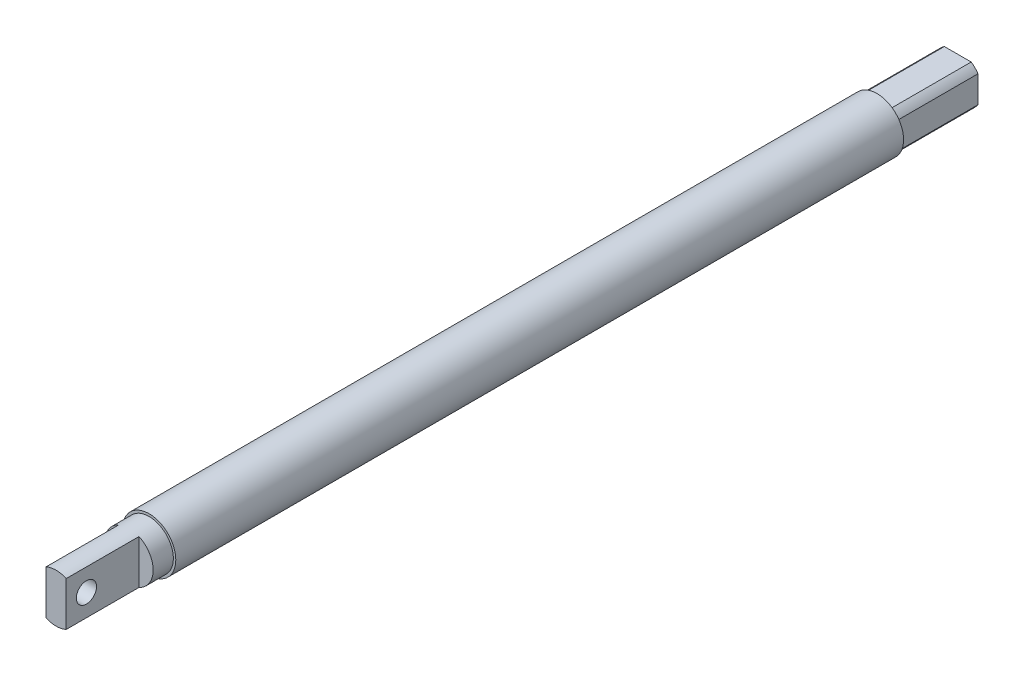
from build123d import *

# Parameters (mm, degrees)
SKETCH1_R               = 3.175
EXTRUDE1_DEPTH          = 25.4
SKETCH2_R               = 8.382
SKETCH2_R_2             = 6.985
EXTRUDE2_DEPTH          = 228.6
SKETCH3_R               = 7.62
EXTRUDE3_DEPTH          = 29.21
SKETCH5_W               = 13.975590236
SKETCH5_H               = 25.4
CUT_EXTRUDE2_DEPTH      = 284.457968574
CUT_EXTRUDE1_DEPTH      = 284.457968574
CUT_EXTRUDE1_DEPTH_BACK = 284.457968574
SKETCH4_R               = 3.175


with BuildPart() as part:
    # Sketch1 → Extrude1 (new body)
    with BuildSketch(Plane.XY):
        with BuildLine():
            Line((-4.212113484, 6.35), (4.212113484, 6.35))
            ThreePointArc((4.212113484, 6.35), (5.388153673, 5.388153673), (6.35, 4.212113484))
            Line((6.35, 4.212113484), (6.35, -4.212113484))
            ThreePointArc((6.35, -4.212113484), (5.388153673, -5.388153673), (4.212113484, -6.35))
            Line((4.212113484, -6.35), (-4.212113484, -6.35))
            ThreePointArc((-4.212113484, -6.35), (-5.388153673, -5.388153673), (-6.35, -4.212113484))
            Line((-6.35, -4.212113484), (-6.35, 4.212113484))
            ThreePointArc((-6.35, 4.212113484), (-5.388153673, 5.388153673), (-4.212113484, 6.35))
        make_face()
        Circle(SKETCH1_R, mode=Mode.SUBTRACT)
    extrude(amount=EXTRUDE1_DEPTH)

    # Sketch2 → Extrude2 (add)
    with BuildSketch(Plane.XY.offset(25.4)):
        Circle(SKETCH2_R)
        with Locations(Location((0, 0, 0), (0, 0, 155.380022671))):
            Circle(SKETCH2_R_2, mode=Mode.SUBTRACT)
    extrude(amount=EXTRUDE2_DEPTH)

    # Sketch3 → Extrude3 (add)
    with BuildSketch(Plane.XY.offset(254)):
        with Locations(Location((0, 0, 0), (0, 0, 180))):
            Circle(SKETCH3_R)
    extrude(amount=EXTRUDE3_DEPTH)

    # Sketch5 → Cut-Extrude2 (cut, symmetric)
    with BuildSketch(Plane(origin=(0, 0, 0), x_dir=(1, 0, 0), z_dir=(0, 1, 0))):
        with Locations((10.162795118, -273.05)):
            Rectangle(SKETCH5_W, SKETCH5_H)
    cut_extrude2 = extrude(amount=CUT_EXTRUDE2_DEPTH, both=True, mode=Mode.SUBTRACT)

    # Mirror1: Cut-Extrude2 across plane
    add(cut_extrude2.mirror(Plane(origin=(0, 0, 0), x_dir=(0, 0, 1), z_dir=(1, 0, 0))), mode=Mode.SUBTRACT)

    # Sketch4 → Cut-Extrude1 (cut, two sides: drawn at the far end of the back side and taken through both)
    with BuildSketch(Plane(origin=(0, 0, 0), x_dir=(0, 0, -1), z_dir=(1, 0, 0)).offset(-CUT_EXTRUDE1_DEPTH_BACK)):
        with Locations(Location((-276.86, 0, 0), (0, 0, 180))):
            Circle(SKETCH4_R)
    extrude(amount=CUT_EXTRUDE1_DEPTH + CUT_EXTRUDE1_DEPTH_BACK, mode=Mode.SUBTRACT)


solid = part.part
